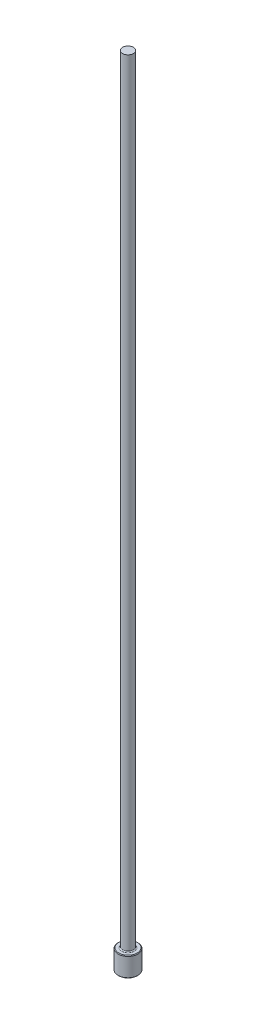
ISO-10303-21;
HEADER;
FILE_DESCRIPTION(('STEP AP214'),'2;1');
FILE_NAME('part.step','',(''),(''),'','','');
FILE_SCHEMA(('AUTOMOTIVE_DESIGN { 1 0 10303 214 1 1 1 1 }'));
ENDSEC;
DATA;
#1=APPLICATION_CONTEXT('core data for automotive mechanical design processes');
#2=APPLICATION_PROTOCOL_DEFINITION('international standard','automotive_design',2000,#1);
#3=PRODUCT_CONTEXT('',#1,'mechanical');
#4=PRODUCT('Part','Part','',(#3));
#5=PRODUCT_RELATED_PRODUCT_CATEGORY('part','',(#4));
#6=PRODUCT_DEFINITION_FORMATION('','',#4);
#7=PRODUCT_DEFINITION_CONTEXT('part definition',#1,'design');
#8=PRODUCT_DEFINITION('design','',#6,#7);
#9=PRODUCT_DEFINITION_SHAPE('','',#8);
#10=(LENGTH_UNIT() NAMED_UNIT(*) SI_UNIT(.MILLI.,.METRE.));
#11=(NAMED_UNIT(*) PLANE_ANGLE_UNIT() SI_UNIT($,.RADIAN.));
#12=(NAMED_UNIT(*) SI_UNIT($,.STERADIAN.) SOLID_ANGLE_UNIT());
#13=UNCERTAINTY_MEASURE_WITH_UNIT(LENGTH_MEASURE(1.E-05),#10,'distance_accuracy_value','');
#14=(GEOMETRIC_REPRESENTATION_CONTEXT(3) GLOBAL_UNCERTAINTY_ASSIGNED_CONTEXT((#13)) GLOBAL_UNIT_ASSIGNED_CONTEXT((#10,
#11,#12)) REPRESENTATION_CONTEXT('',''));
#15=CARTESIAN_POINT('',(0.,0.,0.));
#16=DIRECTION('',(0.,0.,1.));
#17=DIRECTION('',(1.,0.,0.));
#18=AXIS2_PLACEMENT_3D('',#15,#16,#17);
#19=CARTESIAN_POINT('',(0.,0.,0.));
#20=DIRECTION('',(0.,-1.,0.));
#21=DIRECTION('',(0.,0.,-1.));
#22=AXIS2_PLACEMENT_3D('',#19,#20,#21);
#23=PLANE('',#22);
#24=CARTESIAN_POINT('',(0.,0.,0.));
#25=DIRECTION('',(0.,-1.,0.));
#26=DIRECTION('',(0.,0.,-1.));
#27=AXIS2_PLACEMENT_3D('',#24,#25,#26);
#28=CIRCLE('',#27,0.736599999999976);
#29=CARTESIAN_POINT('',(0.,0.,0.736599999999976));
#30=VERTEX_POINT('',#29);
#31=EDGE_CURVE('E46',#30,#30,#28,.T.);
#32=ORIENTED_EDGE('',*,*,#31,.T.);
#33=EDGE_LOOP('',(#32));
#34=FACE_BOUND('',#33,.T.);
#35=ADVANCED_FACE('F35',(#34),#23,.T.);
#36=CARTESIAN_POINT('',(0.,259.958771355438,0.));
#37=DIRECTION('',(0.,1.,0.));
#38=DIRECTION('',(0.,0.,1.));
#39=AXIS2_PLACEMENT_3D('',#36,#37,#38);
#40=CYLINDRICAL_SURFACE('',#39,0.787399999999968);
#41=CARTESIAN_POINT('',(0.,1.52399999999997,0.));
#42=DIRECTION('',(0.,1.,0.));
#43=DIRECTION('',(0.,0.,1.));
#44=AXIS2_PLACEMENT_3D('',#41,#42,#43);
#45=CIRCLE('',#44,0.787399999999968);
#46=CARTESIAN_POINT('',(0.,1.52399999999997,0.787399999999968));
#47=VERTEX_POINT('',#46);
#48=EDGE_CURVE('E50',#47,#47,#45,.F.);
#49=ORIENTED_EDGE('',*,*,#48,.T.);
#50=EDGE_LOOP('',(#49));
#51=FACE_BOUND('',#50,.T.);
#52=CARTESIAN_POINT('',(0.,0.050799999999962,0.));
#53=DIRECTION('',(0.,-1.,0.));
#54=DIRECTION('',(0.,0.,-1.));
#55=AXIS2_PLACEMENT_3D('',#52,#53,#54);
#56=CIRCLE('',#55,0.787399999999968);
#57=CARTESIAN_POINT('',(0.,0.050799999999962,0.787399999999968));
#58=VERTEX_POINT('',#57);
#59=EDGE_CURVE('E55',#58,#58,#56,.F.);
#60=ORIENTED_EDGE('',*,*,#59,.T.);
#61=EDGE_LOOP('',(#60));
#62=FACE_BOUND('',#61,.T.);
#63=ADVANCED_FACE('F77',(#51,#62),#40,.T.);
#64=CARTESIAN_POINT('',(-0.787399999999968,1.5748,0.));
#65=DIRECTION('',(0.,1.,0.));
#66=DIRECTION('',(0.,0.,1.));
#67=AXIS2_PLACEMENT_3D('',#64,#65,#66);
#68=PLANE('',#67);
#69=CARTESIAN_POINT('',(0.,1.5748,0.));
#70=DIRECTION('',(0.,1.,0.));
#71=DIRECTION('',(0.,0.,1.));
#72=AXIS2_PLACEMENT_3D('',#69,#70,#71);
#73=CIRCLE('',#72,0.507999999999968);
#74=CARTESIAN_POINT('',(0.,1.5748,0.507999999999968));
#75=VERTEX_POINT('',#74);
#76=EDGE_CURVE('E10',#75,#75,#73,.F.);
#77=ORIENTED_EDGE('',*,*,#76,.T.);
#78=EDGE_LOOP('',(#77));
#79=FACE_BOUND('',#78,.T.);
#80=CARTESIAN_POINT('',(0.,1.5748,0.));
#81=DIRECTION('',(0.,1.,0.));
#82=DIRECTION('',(0.,0.,1.));
#83=AXIS2_PLACEMENT_3D('',#80,#81,#82);
#84=CIRCLE('',#83,0.73659999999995);
#85=CARTESIAN_POINT('',(0.,1.5748,0.73659999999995));
#86=VERTEX_POINT('',#85);
#87=EDGE_CURVE('E58',#86,#86,#84,.T.);
#88=ORIENTED_EDGE('',*,*,#87,.T.);
#89=EDGE_LOOP('',(#88));
#90=FACE_BOUND('',#89,.T.);
#91=ADVANCED_FACE('F69',(#79,#90),#68,.T.);
#92=CARTESIAN_POINT('',(0.,259.958771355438,0.));
#93=DIRECTION('',(0.,1.,0.));
#94=DIRECTION('',(0.,0.,1.));
#95=AXIS2_PLACEMENT_3D('',#92,#93,#94);
#96=CYLINDRICAL_SURFACE('',#95,0.431799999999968);
#97=CARTESIAN_POINT('',(0.,1.65100000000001,0.));
#98=DIRECTION('',(0.,1.,0.));
#99=DIRECTION('',(0.,0.,1.));
#100=AXIS2_PLACEMENT_3D('',#97,#98,#99);
#101=CIRCLE('',#100,0.431799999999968);
#102=CARTESIAN_POINT('',(0.,1.65100000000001,0.431799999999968));
#103=VERTEX_POINT('',#102);
#104=EDGE_CURVE('E42',#103,#103,#101,.T.);
#105=ORIENTED_EDGE('',*,*,#104,.T.);
#106=EDGE_LOOP('',(#105));
#107=FACE_BOUND('',#106,.T.);
#108=CARTESIAN_POINT('',(0.,63.5,0.));
#109=DIRECTION('',(0.,1.,0.));
#110=DIRECTION('',(0.,0.,1.));
#111=AXIS2_PLACEMENT_3D('',#108,#109,#110);
#112=CIRCLE('',#111,0.431799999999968);
#113=CARTESIAN_POINT('',(0.,63.5,0.431799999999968));
#114=VERTEX_POINT('',#113);
#115=EDGE_CURVE('E61',#114,#114,#112,.T.);
#116=ORIENTED_EDGE('',*,*,#115,.F.);
#117=EDGE_LOOP('',(#116));
#118=FACE_BOUND('',#117,.T.);
#119=ADVANCED_FACE('F67',(#107,#118),#96,.T.);
#120=CARTESIAN_POINT('',(-0.431799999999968,63.5,0.));
#121=DIRECTION('',(0.,1.,0.));
#122=DIRECTION('',(0.,0.,1.));
#123=AXIS2_PLACEMENT_3D('',#120,#121,#122);
#124=PLANE('',#123);
#125=ORIENTED_EDGE('',*,*,#115,.T.);
#126=EDGE_LOOP('',(#125));
#127=FACE_BOUND('',#126,.T.);
#128=ADVANCED_FACE('F65',(#127),#124,.T.);
#129=CARTESIAN_POINT('',(0.,1.57479999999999,0.));
#130=DIRECTION('',(0.,-1.,0.));
#131=DIRECTION('',(0.,0.,-1.));
#132=AXIS2_PLACEMENT_3D('',#129,#130,#131);
#133=CONICAL_SURFACE('',#132,0.736599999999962,0.785398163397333);
#134=ORIENTED_EDGE('',*,*,#48,.F.);
#135=EDGE_LOOP('',(#134));
#136=FACE_BOUND('',#135,.T.);
#137=ORIENTED_EDGE('',*,*,#87,.F.);
#138=EDGE_LOOP('',(#137));
#139=FACE_BOUND('',#138,.T.);
#140=ADVANCED_FACE('F75',(#136,#139),#133,.T.);
#141=CARTESIAN_POINT('',(0.,0.050799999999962,0.));
#142=DIRECTION('',(0.,1.,0.));
#143=DIRECTION('',(0.,0.,1.));
#144=AXIS2_PLACEMENT_3D('',#141,#142,#143);
#145=CONICAL_SURFACE('',#144,0.787399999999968,0.785398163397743);
#146=CARTESIAN_POINT('',(0.,0.,0.736599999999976));
#147=CARTESIAN_POINT('',(0.,0.000529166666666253,0.737129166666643));
#148=CARTESIAN_POINT('',(0.,0.00105833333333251,0.737658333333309));
#149=CARTESIAN_POINT('',(0.,0.00211666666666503,0.738716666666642));
#150=CARTESIAN_POINT('',(0.,0.00264583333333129,0.739245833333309));
#151=CARTESIAN_POINT('',(0.,0.00370416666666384,0.740304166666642));
#152=CARTESIAN_POINT('',(0.,0.00423333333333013,0.740833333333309));
#153=CARTESIAN_POINT('',(0.,0.00529166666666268,0.741891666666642));
#154=CARTESIAN_POINT('',(0.,0.00582083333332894,0.742420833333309));
#155=CARTESIAN_POINT('',(0.,0.00687916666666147,0.743479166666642));
#156=CARTESIAN_POINT('',(0.,0.00740833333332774,0.744008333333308));
#157=CARTESIAN_POINT('',(0.,0.00846666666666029,0.745066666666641));
#158=CARTESIAN_POINT('',(0.,0.00899583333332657,0.745595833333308));
#159=CARTESIAN_POINT('',(0.,0.0100541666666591,0.746654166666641));
#160=CARTESIAN_POINT('',(0.,0.0105833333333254,0.747183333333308));
#161=CARTESIAN_POINT('',(0.,0.0116416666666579,0.748241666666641));
#162=CARTESIAN_POINT('',(0.,0.0121708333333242,0.748770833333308));
#163=CARTESIAN_POINT('',(0.,0.0132291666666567,0.749829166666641));
#164=CARTESIAN_POINT('',(0.,0.013758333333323,0.750358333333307));
#165=CARTESIAN_POINT('',(0.,0.0148166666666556,0.75141666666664));
#166=CARTESIAN_POINT('',(0.,0.0153458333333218,0.751945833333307));
#167=CARTESIAN_POINT('',(0.,0.0164041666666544,0.75300416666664));
#168=CARTESIAN_POINT('',(0.,0.0169333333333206,0.753533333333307));
#169=CARTESIAN_POINT('',(0.,0.0179916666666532,0.75459166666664));
#170=CARTESIAN_POINT('',(0.,0.0185208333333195,0.755120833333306));
#171=CARTESIAN_POINT('',(0.,0.019579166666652,0.75617916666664));
#172=CARTESIAN_POINT('',(0.,0.0201083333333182,0.756708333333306));
#173=CARTESIAN_POINT('',(0.,0.0211666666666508,0.757766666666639));
#174=CARTESIAN_POINT('',(0.,0.0216958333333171,0.758295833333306));
#175=CARTESIAN_POINT('',(0.,0.0227541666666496,0.759354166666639));
#176=CARTESIAN_POINT('',(0.,0.0232833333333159,0.759883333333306));
#177=CARTESIAN_POINT('',(0.,0.0243416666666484,0.760941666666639));
#178=CARTESIAN_POINT('',(0.,0.0248708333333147,0.761470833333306));
#179=CARTESIAN_POINT('',(0.,0.0259291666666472,0.762529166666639));
#180=CARTESIAN_POINT('',(0.,0.0264583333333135,0.763058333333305));
#181=CARTESIAN_POINT('',(0.,0.0275166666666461,0.764116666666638));
#182=CARTESIAN_POINT('',(0.,0.0280458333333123,0.764645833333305));
#183=CARTESIAN_POINT('',(0.,0.0291041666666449,0.765704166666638));
#184=CARTESIAN_POINT('',(0.,0.0296333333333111,0.766233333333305));
#185=CARTESIAN_POINT('',(0.,0.0306916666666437,0.767291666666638));
#186=CARTESIAN_POINT('',(0.,0.03122083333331,0.767820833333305));
#187=CARTESIAN_POINT('',(0.,0.0322791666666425,0.768879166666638));
#188=CARTESIAN_POINT('',(0.,0.0328083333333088,0.769408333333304));
#189=CARTESIAN_POINT('',(0.,0.0338666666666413,0.770466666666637));
#190=CARTESIAN_POINT('',(0.,0.0343958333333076,0.770995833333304));
#191=CARTESIAN_POINT('',(0.,0.0354541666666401,0.772054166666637));
#192=CARTESIAN_POINT('',(0.,0.0359833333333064,0.772583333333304));
#193=CARTESIAN_POINT('',(0.,0.0370416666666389,0.773641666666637));
#194=CARTESIAN_POINT('',(0.,0.0375708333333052,0.774170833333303));
#195=CARTESIAN_POINT('',(0.,0.0386291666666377,0.775229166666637));
#196=CARTESIAN_POINT('',(0.,0.039158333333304,0.775758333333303));
#197=CARTESIAN_POINT('',(0.,0.0402166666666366,0.776816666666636));
#198=CARTESIAN_POINT('',(0.,0.0407458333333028,0.777345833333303));
#199=CARTESIAN_POINT('',(0.,0.0418041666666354,0.778404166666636));
#200=CARTESIAN_POINT('',(0.,0.0423333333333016,0.778933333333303));
#201=CARTESIAN_POINT('',(0.,0.0433916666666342,0.779991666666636));
#202=CARTESIAN_POINT('',(0.,0.0439208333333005,0.780520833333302));
#203=CARTESIAN_POINT('',(0.,0.044979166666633,0.781579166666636));
#204=CARTESIAN_POINT('',(0.,0.0455083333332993,0.782108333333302));
#205=CARTESIAN_POINT('',(0.,0.0465666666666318,0.783166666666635));
#206=CARTESIAN_POINT('',(0.,0.0470958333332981,0.783695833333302));
#207=CARTESIAN_POINT('',(0.,0.0481541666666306,0.784754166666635));
#208=CARTESIAN_POINT('',(0.,0.0486833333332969,0.785283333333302));
#209=CARTESIAN_POINT('',(0.,0.0497416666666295,0.786341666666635));
#210=CARTESIAN_POINT('',(0.,0.0502708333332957,0.786870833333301));
#211=CARTESIAN_POINT('',(0.,0.050799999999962,0.787399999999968));
#212=B_SPLINE_CURVE_WITH_KNOTS('',3,(#146,#147,#148,#149,#150,#151,#152,#153,#154,#155,#156,
#157,#158,#159,#160,#161,#162,#163,#164,#165,#166,#167,#168,#169,#170,#171,#172,#173,#174,#175,
#176,#177,#178,#179,#180,#181,#182,#183,#184,#185,#186,#187,#188,#189,#190,#191,#192,#193,#194,
#195,#196,#197,#198,#199,#200,#201,#202,#203,#204,#205,#206,#207,#208,#209,#210,#211),
.UNSPECIFIED.,.F.,.F.,(4,2,2,2,2,2,2,2,2,2,2,2,2,2,2,2,2,2,2,2,2,2,2,2,2,2,2,2,2,2,2,2,4),(0.,
0.00224506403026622,0.00449012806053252,0.00673519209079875,0.00898025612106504,
0.0112253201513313,0.0134703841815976,0.0157154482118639,0.0179605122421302,0.0202055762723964,
0.0224506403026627,0.024695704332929,0.0269407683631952,0.0291858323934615,0.0314308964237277,
0.033675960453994,0.0359210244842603,0.0381660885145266,0.0404111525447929,0.0426562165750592,
0.0449012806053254,0.0471463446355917,0.049391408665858,0.0516364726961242,0.0538815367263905,
0.0561266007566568,0.058371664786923,0.0606167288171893,0.0628617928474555,0.0651068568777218,
0.0673519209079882,0.0695969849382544,0.0718420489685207),.UNSPECIFIED.);
#213=EDGE_CURVE('BSEAM89',#30,#58,#212,.T.);
#214=ORIENTED_EDGE('',*,*,#31,.F.);
#215=ORIENTED_EDGE('',*,*,#59,.F.);
#216=ORIENTED_EDGE('',*,*,#213,.T.);
#217=ORIENTED_EDGE('',*,*,#213,.F.);
#218=EDGE_LOOP('',(#214,#216,#215,#217));
#219=FACE_BOUND('',#218,.T.);
#220=ADVANCED_FACE('F89',(#219),#145,.T.);
#221=CARTESIAN_POINT('',(0.,1.65100000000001,0.));
#222=DIRECTION('',(0.,1.,0.));
#223=DIRECTION('',(0.,0.,1.));
#224=AXIS2_PLACEMENT_3D('',#221,#222,#223);
#225=TOROIDAL_SURFACE('',#224,0.507999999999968,0.0762);
#226=ORIENTED_EDGE('',*,*,#76,.F.);
#227=EDGE_LOOP('',(#226));
#228=FACE_BOUND('',#227,.T.);
#229=ORIENTED_EDGE('',*,*,#104,.F.);
#230=EDGE_LOOP('',(#229));
#231=FACE_BOUND('',#230,.T.);
#232=ADVANCED_FACE('F37',(#228,#231),#225,.F.);
#233=CLOSED_SHELL('',(#35,#63,#91,#119,#128,#140,#220,#232));
#234=MANIFOLD_SOLID_BREP('B2',#233);
#235=ADVANCED_BREP_SHAPE_REPRESENTATION('',(#18,#234),#14);
#236=SHAPE_DEFINITION_REPRESENTATION(#9,#235);
ENDSEC;
END-ISO-10303-21;
